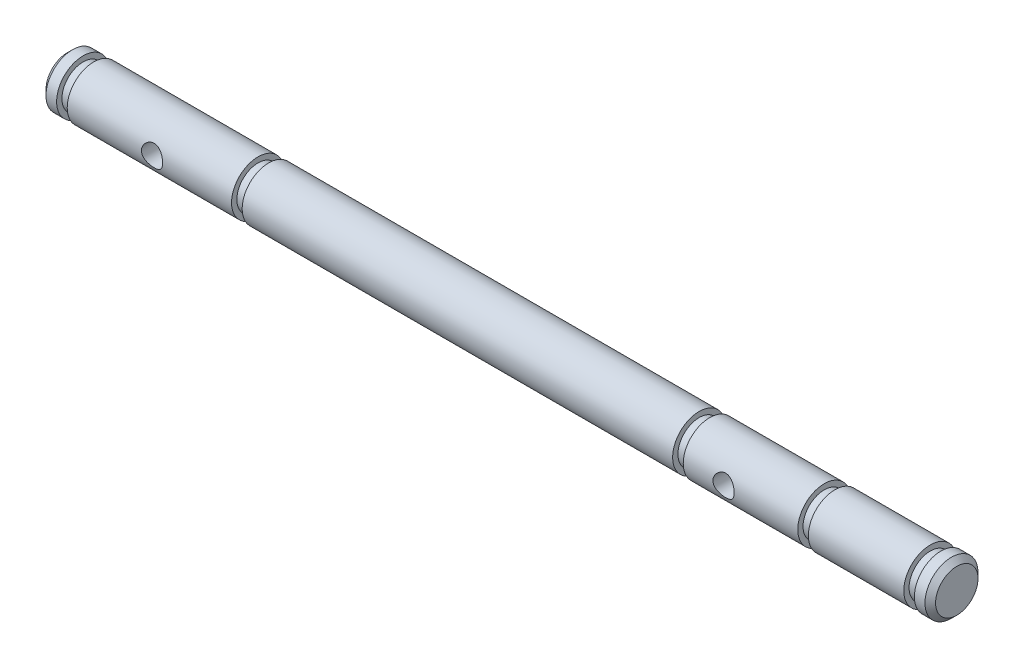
from build123d import *

# Parameters (mm, degrees)
CHANFREIN1_SIZE              = 0.5
ENL_V_MAT_EXTRU_1_DEPTH      = 84.974460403
ENL_V_MAT_EXTRU_1_DEPTH_BACK = 84.974460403
ESQUISSE2_R                  = 1


with BuildPart() as part:
    # Esquisse1 → Base-R_volution (revolve)
    with BuildSketch(Plane.XY, mode=Mode.PRIVATE) as base_r_volution_sk:
        Polygon((2.5, 2.5), (18, 2.5), (18, 2), (19, 2), (19, 2.5), (59.6, 2.5), (59.6, 2), (60.6, 2), (60.6, 2.5), (71.4, 2.5), (71.4, 2), (72.4, 2), (72.4, 2.5), (81.4, 2.5), (81.4, 2), (82.4, 2), (82.4, 2.5), (83.9, 2.5), (83.9, 0), (0, 0), (0, 2.5), (1.5, 2.5), (1.5, 2), (2.5, 2), align=None)
    revolve(base_r_volution_sk.sketch.rotate(Axis((-4.729322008, 0, 0), (1, 0, 0)), 90), axis=Axis((-4.729322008, 0, 0), (1, 0, 0)))

    # Chanfrein1
    chanfrein1_edges = [part.edges().sort_by_distance(p)[0] for p in [
        (83.9, 0, -2.5),
        (0, 0, -2.5),
    ]]
    chamfer(chanfrein1_edges, length=CHANFREIN1_SIZE)

    # Esquisse2 → Enl_v. mat.-Extru.1 (cut, two sides: drawn at the far end of the back side and taken through both)
    with BuildSketch(Plane.XY.offset(-ENL_V_MAT_EXTRU_1_DEPTH_BACK)):
        with Locations((10.5, 0)):
            Circle(ESQUISSE2_R)
        with Locations((64.4, 0)):
            Circle(ESQUISSE2_R)
    extrude(amount=ENL_V_MAT_EXTRU_1_DEPTH + ENL_V_MAT_EXTRU_1_DEPTH_BACK, mode=Mode.SUBTRACT)


solid = part.part
